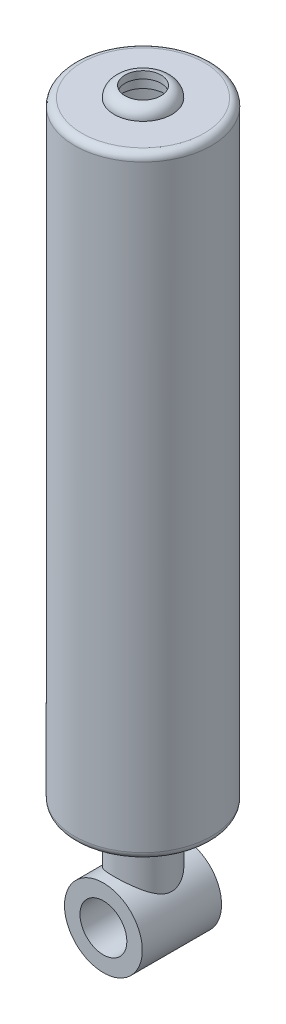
ISO-10303-21;
HEADER;
FILE_DESCRIPTION(('STEP AP214'),'2;1');
FILE_NAME('part.step','',(''),(''),'','','');
FILE_SCHEMA(('AUTOMOTIVE_DESIGN { 1 0 10303 214 1 1 1 1 }'));
ENDSEC;
DATA;
#1=APPLICATION_CONTEXT('core data for automotive mechanical design processes');
#2=APPLICATION_PROTOCOL_DEFINITION('international standard','automotive_design',2000,#1);
#3=PRODUCT_CONTEXT('',#1,'mechanical');
#4=PRODUCT('Part','Part','',(#3));
#5=PRODUCT_RELATED_PRODUCT_CATEGORY('part','',(#4));
#6=PRODUCT_DEFINITION_FORMATION('','',#4);
#7=PRODUCT_DEFINITION_CONTEXT('part definition',#1,'design');
#8=PRODUCT_DEFINITION('design','',#6,#7);
#9=PRODUCT_DEFINITION_SHAPE('','',#8);
#10=(LENGTH_UNIT() NAMED_UNIT(*) SI_UNIT(.MILLI.,.METRE.));
#11=(NAMED_UNIT(*) PLANE_ANGLE_UNIT() SI_UNIT($,.RADIAN.));
#12=(NAMED_UNIT(*) SI_UNIT($,.STERADIAN.) SOLID_ANGLE_UNIT());
#13=UNCERTAINTY_MEASURE_WITH_UNIT(LENGTH_MEASURE(1.E-05),#10,'distance_accuracy_value','');
#14=(GEOMETRIC_REPRESENTATION_CONTEXT(3) GLOBAL_UNCERTAINTY_ASSIGNED_CONTEXT((#13)) GLOBAL_UNIT_ASSIGNED_CONTEXT((#10,
#11,#12)) REPRESENTATION_CONTEXT('',''));
#15=CARTESIAN_POINT('',(0.,0.,0.));
#16=DIRECTION('',(0.,0.,1.));
#17=DIRECTION('',(1.,0.,0.));
#18=AXIS2_PLACEMENT_3D('',#15,#16,#17);
#19=CARTESIAN_POINT('',(0.,0.,22.));
#20=DIRECTION('',(0.,0.,-1.));
#21=DIRECTION('',(-1.,0.,0.));
#22=AXIS2_PLACEMENT_3D('',#19,#20,#21);
#23=CYLINDRICAL_SURFACE('',#22,6.5);
#24=CARTESIAN_POINT('',(0.,0.,22.));
#25=DIRECTION('',(0.,0.,-1.));
#26=DIRECTION('',(-1.,0.,0.));
#27=AXIS2_PLACEMENT_3D('',#24,#25,#26);
#28=CIRCLE('',#27,6.5);
#29=CARTESIAN_POINT('',(-6.5,0.,22.));
#30=VERTEX_POINT('',#29);
#31=EDGE_CURVE('E34',#30,#30,#28,.T.);
#32=ORIENTED_EDGE('',*,*,#31,.F.);
#33=EDGE_LOOP('',(#32));
#34=FACE_BOUND('',#33,.T.);
#35=CARTESIAN_POINT('',(0.,0.,0.));
#36=DIRECTION('',(0.,0.,-1.));
#37=DIRECTION('',(-1.,0.,0.));
#38=AXIS2_PLACEMENT_3D('',#35,#36,#37);
#39=CIRCLE('',#38,6.5);
#40=CARTESIAN_POINT('',(-6.5,0.,0.));
#41=VERTEX_POINT('',#40);
#42=EDGE_CURVE('E380',#41,#41,#39,.T.);
#43=ORIENTED_EDGE('',*,*,#42,.T.);
#44=EDGE_LOOP('',(#43));
#45=FACE_BOUND('',#44,.T.);
#46=ADVANCED_FACE('F30',(#34,#45),#23,.F.);
#47=CARTESIAN_POINT('',(-10.995073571,-11.014063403,22.));
#48=DIRECTION('',(0.,0.,1.));
#49=DIRECTION('',(1.,0.,0.));
#50=AXIS2_PLACEMENT_3D('',#47,#48,#49);
#51=PLANE('',#50);
#52=ORIENTED_EDGE('',*,*,#31,.T.);
#53=EDGE_LOOP('',(#52));
#54=FACE_BOUND('',#53,.T.);
#55=CARTESIAN_POINT('',(0.,0.,22.));
#56=DIRECTION('',(0.,0.,-1.));
#57=DIRECTION('',(-1.,0.,0.));
#58=AXIS2_PLACEMENT_3D('',#55,#56,#57);
#59=CIRCLE('',#58,10.8);
#60=CARTESIAN_POINT('',(-10.8,0.,22.));
#61=VERTEX_POINT('',#60);
#62=EDGE_CURVE('E381',#61,#61,#59,.T.);
#63=ORIENTED_EDGE('',*,*,#62,.F.);
#64=EDGE_LOOP('',(#63));
#65=FACE_BOUND('',#64,.T.);
#66=ADVANCED_FACE('F139',(#54,#65),#51,.T.);
#67=CARTESIAN_POINT('',(-10.995073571,-11.014063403,0.));
#68=DIRECTION('',(0.,0.,1.));
#69=DIRECTION('',(1.,0.,0.));
#70=AXIS2_PLACEMENT_3D('',#67,#68,#69);
#71=PLANE('',#70);
#72=ORIENTED_EDGE('',*,*,#42,.F.);
#73=EDGE_LOOP('',(#72));
#74=FACE_BOUND('',#73,.T.);
#75=CARTESIAN_POINT('',(0.,0.,0.));
#76=DIRECTION('',(0.,0.,-1.));
#77=DIRECTION('',(-1.,0.,0.));
#78=AXIS2_PLACEMENT_3D('',#75,#76,#77);
#79=CIRCLE('',#78,10.8);
#80=CARTESIAN_POINT('',(-10.8,0.,0.));
#81=VERTEX_POINT('',#80);
#82=EDGE_CURVE('E97',#81,#81,#79,.F.);
#83=ORIENTED_EDGE('',*,*,#82,.F.);
#84=EDGE_LOOP('',(#83));
#85=FACE_BOUND('',#84,.T.);
#86=ADVANCED_FACE('F142',(#74,#85),#71,.F.);
#87=CARTESIAN_POINT('',(0.,0.,22.));
#88=DIRECTION('',(0.,0.,-1.));
#89=DIRECTION('',(-1.,0.,0.));
#90=AXIS2_PLACEMENT_3D('',#87,#88,#89);
#91=CYLINDRICAL_SURFACE('',#90,10.8);
#92=ORIENTED_EDGE('',*,*,#82,.T.);
#93=EDGE_LOOP('',(#92));
#94=FACE_BOUND('',#93,.T.);
#95=CARTESIAN_POINT('',(-5.74679859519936E-10,10.8,3.));
#96=CARTESIAN_POINT('',(-0.196073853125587,10.7999997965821,3.00000021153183));
#97=CARTESIAN_POINT('',(-0.392150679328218,10.7946492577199,3.00721908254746));
#98=CARTESIAN_POINT('',(-0.782748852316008,10.7733736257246,3.03597637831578));
#99=CARTESIAN_POINT('',(-0.977269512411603,10.7574440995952,3.05752080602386));
#100=CARTESIAN_POINT('',(-1.36337863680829,10.7153611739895,3.11461242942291));
#101=CARTESIAN_POINT('',(-1.55496288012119,10.6891942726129,3.15017811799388));
#102=CARTESIAN_POINT('',(-1.93362010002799,10.6272263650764,3.23477180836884));
#103=CARTESIAN_POINT('',(-2.12069106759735,10.5914211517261,3.28380568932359));
#104=CARTESIAN_POINT('',(-2.48788747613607,10.5112091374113,3.39428172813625));
#105=CARTESIAN_POINT('',(-2.66804907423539,10.4668576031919,3.45564426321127));
#106=CARTESIAN_POINT('',(-3.02177256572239,10.3702710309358,3.59022822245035));
#107=CARTESIAN_POINT('',(-3.1953318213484,10.3180328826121,3.66345432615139));
#108=CARTESIAN_POINT('',(-3.5349262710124,10.2066748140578,3.82091182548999));
#109=CARTESIAN_POINT('',(-3.70096623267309,10.1475593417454,3.90513611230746));
#110=CARTESIAN_POINT('',(-4.02514814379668,10.0233889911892,4.08389830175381));
#111=CARTESIAN_POINT('',(-4.18328712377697,9.95833190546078,4.17844004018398));
#112=CARTESIAN_POINT('',(-4.50531800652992,9.81711695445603,4.38621765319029));
#113=CARTESIAN_POINT('',(-4.66840995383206,9.74048812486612,4.50037265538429));
#114=CARTESIAN_POINT('',(-4.98428814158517,9.58269534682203,4.73932094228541));
#115=CARTESIAN_POINT('',(-5.13707306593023,9.50153082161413,4.86411558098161));
#116=CARTESIAN_POINT('',(-5.43229552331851,9.33589064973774,5.12387177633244));
#117=CARTESIAN_POINT('',(-5.57471695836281,9.25141015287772,5.25884851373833));
#118=CARTESIAN_POINT('',(-5.84871315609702,9.0806722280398,5.53823916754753));
#119=CARTESIAN_POINT('',(-5.98029091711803,8.99441529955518,5.68265045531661));
#120=CARTESIAN_POINT('',(-6.25750864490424,8.80438176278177,6.01017892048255));
#121=CARTESIAN_POINT('',(-6.40075250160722,8.70052752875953,6.19528762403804));
#122=CARTESIAN_POINT('',(-6.67104996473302,8.49505272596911,6.57822982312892));
#123=CARTESIAN_POINT('',(-6.7980987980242,8.3934328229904,6.77606704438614));
#124=CARTESIAN_POINT('',(-7.03519757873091,8.19571758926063,7.18403796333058));
#125=CARTESIAN_POINT('',(-7.14526535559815,8.09961653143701,7.39415843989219));
#126=CARTESIAN_POINT('',(-7.34750136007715,7.91661626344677,7.82648223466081));
#127=CARTESIAN_POINT('',(-7.43967969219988,7.82971187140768,8.04867864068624));
#128=CARTESIAN_POINT('',(-7.63159320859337,7.64343059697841,8.57891522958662));
#129=CARTESIAN_POINT('',(-7.72415199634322,7.54909207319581,8.89150099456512));
#130=CARTESIAN_POINT('',(-7.83448428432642,7.4339542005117,9.3727429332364));
#131=CARTESIAN_POINT('',(-7.86650067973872,7.3999816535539,9.53512225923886));
#132=CARTESIAN_POINT('',(-7.92057047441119,7.34208008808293,9.86326585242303));
#133=CARTESIAN_POINT('',(-7.94262893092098,7.31814597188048,10.0290283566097));
#134=CARTESIAN_POINT('',(-7.97649742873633,7.2812175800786,10.3642924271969));
#135=CARTESIAN_POINT('',(-7.98821668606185,7.26832024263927,10.533813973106));
#136=CARTESIAN_POINT('',(-8.00081134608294,7.25445437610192,10.8737481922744));
#137=CARTESIAN_POINT('',(-8.00168722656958,7.25348532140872,11.0441608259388));
#138=CARTESIAN_POINT('',(-7.99257155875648,7.26352834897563,11.3844251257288));
#139=CARTESIAN_POINT('',(-7.98257429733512,7.2745467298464,11.5542764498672));
#140=CARTESIAN_POINT('',(-7.95193699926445,7.3080233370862,11.8918735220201));
#141=CARTESIAN_POINT('',(-7.93129579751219,7.33048281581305,12.0596190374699));
#142=CARTESIAN_POINT('',(-7.87723780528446,7.38856195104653,12.4082837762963));
#143=CARTESIAN_POINT('',(-7.84275526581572,7.4252676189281,12.5888555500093));
#144=CARTESIAN_POINT('',(-7.76213885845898,7.50949985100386,12.9448789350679));
#145=CARTESIAN_POINT('',(-7.71599721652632,7.55703363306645,13.1203270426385));
#146=CARTESIAN_POINT('',(-7.61271453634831,7.66106729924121,13.465585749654));
#147=CARTESIAN_POINT('',(-7.55555251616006,7.71758424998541,13.6353848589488));
#148=CARTESIAN_POINT('',(-7.4309787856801,7.83760393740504,13.9685315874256));
#149=CARTESIAN_POINT('',(-7.36356977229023,7.90110483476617,14.1318808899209));
#150=CARTESIAN_POINT('',(-7.19258635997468,8.05757896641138,14.5105926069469));
#151=CARTESIAN_POINT('',(-7.08480350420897,8.15283503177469,14.7231192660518));
#152=CARTESIAN_POINT('',(-6.85215307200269,8.34932365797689,15.1357127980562));
#153=CARTESIAN_POINT('',(-6.72727965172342,8.45055825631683,15.3357753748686));
#154=CARTESIAN_POINT('',(-6.46102961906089,8.655829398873,15.7233911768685));
#155=CARTESIAN_POINT('',(-6.31963737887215,8.75986852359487,15.9109322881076));
#156=CARTESIAN_POINT('',(-6.02092544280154,8.96780783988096,16.2729033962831));
#157=CARTESIAN_POINT('',(-5.86360767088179,9.07170804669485,16.4473349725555));
#158=CARTESIAN_POINT('',(-5.53071411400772,9.27848107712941,16.7851823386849));
#159=CARTESIAN_POINT('',(-5.35488559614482,9.38131057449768,16.9483761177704));
#160=CARTESIAN_POINT('',(-4.98746208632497,9.58170196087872,17.2596476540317));
#161=CARTESIAN_POINT('',(-4.79586526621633,9.67926323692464,17.4077236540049));
#162=CARTESIAN_POINT('',(-4.39777000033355,9.8665053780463,17.6872017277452));
#163=CARTESIAN_POINT('',(-4.19129629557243,9.95619880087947,17.8186305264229));
#164=CARTESIAN_POINT('',(-3.76403650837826,10.1254515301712,18.0634687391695));
#165=CARTESIAN_POINT('',(-3.54325618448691,10.205014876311,18.1768853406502));
#166=CARTESIAN_POINT('',(-3.14654951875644,10.3330029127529,18.3575746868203));
#167=CARTESIAN_POINT('',(-2.97350657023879,10.3841992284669,18.4292452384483));
#168=CARTESIAN_POINT('',(-2.62093896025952,10.4787387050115,18.5608241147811));
#169=CARTESIAN_POINT('',(-2.44141575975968,10.5220836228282,18.6207350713));
#170=CARTESIAN_POINT('',(-2.07716948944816,10.5999993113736,18.7279582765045));
#171=CARTESIAN_POINT('',(-1.89245716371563,10.6345869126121,18.7752947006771));
#172=CARTESIAN_POINT('',(-1.51872493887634,10.6943567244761,18.856846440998));
#173=CARTESIAN_POINT('',(-1.32970671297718,10.7195425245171,18.8910667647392));
#174=CARTESIAN_POINT('',(-0.951315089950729,10.7596787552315,18.9455031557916));
#175=CARTESIAN_POINT('',(-0.761983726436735,10.7747675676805,18.9659086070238));
#176=CARTESIAN_POINT('',(-0.381769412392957,10.7949294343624,18.9931586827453));
#177=CARTESIAN_POINT('',(-0.190886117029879,10.8000001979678,19.0000002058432));
#178=CARTESIAN_POINT('',(0.196073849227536,10.799999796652,18.9999997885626));
#179=CARTESIAN_POINT('',(0.392150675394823,10.7946492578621,18.9927809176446));
#180=CARTESIAN_POINT('',(0.782748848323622,10.7733736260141,18.9640236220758));
#181=CARTESIAN_POINT('',(0.977269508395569,10.7574440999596,18.9424791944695));
#182=CARTESIAN_POINT('',(1.36337863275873,10.7153611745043,18.8853875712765));
#183=CARTESIAN_POINT('',(1.55496287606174,10.6891942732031,18.8498218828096));
#184=CARTESIAN_POINT('',(1.93362009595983,10.6272263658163,18.7652281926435));
#185=CARTESIAN_POINT('',(2.12069106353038,10.5914211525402,18.7161943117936));
#186=CARTESIAN_POINT('',(2.48788747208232,10.5112091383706,18.6057182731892));
#187=CARTESIAN_POINT('',(2.66804907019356,10.4668576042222,18.5443557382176));
#188=CARTESIAN_POINT('',(3.02177256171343,10.370271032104,18.409771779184));
#189=CARTESIAN_POINT('',(3.19533181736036,10.3180328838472,18.336545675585));
#190=CARTESIAN_POINT('',(3.53492626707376,10.2066748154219,18.1790881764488));
#191=CARTESIAN_POINT('',(3.70096622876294,10.1475593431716,18.0948638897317));
#192=CARTESIAN_POINT('',(4.02514813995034,10.0233889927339,17.9161017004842));
#193=CARTESIAN_POINT('',(4.18328711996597,9.95833190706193,17.8215599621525));
#194=CARTESIAN_POINT('',(4.50531800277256,9.81711695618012,17.6137823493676));
#195=CARTESIAN_POINT('',(4.66840995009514,9.74048812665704,17.4996273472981));
#196=CARTESIAN_POINT('',(4.98428813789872,9.58269534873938,17.2606790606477));
#197=CARTESIAN_POINT('',(5.13707306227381,9.50153082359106,17.1358844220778));
#198=CARTESIAN_POINT('',(5.43229551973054,9.33589065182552,16.8761282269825));
#199=CARTESIAN_POINT('',(5.57471695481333,9.25141015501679,16.7411514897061));
#200=CARTESIAN_POINT('',(5.84871315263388,9.08067223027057,16.4617608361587));
#201=CARTESIAN_POINT('',(5.98029091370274,8.99441530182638,16.317349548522));
#202=CARTESIAN_POINT('',(6.25750864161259,8.80438176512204,15.9898210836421));
#203=CARTESIAN_POINT('',(6.40075249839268,8.70052753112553,15.8047123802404));
#204=CARTESIAN_POINT('',(6.67104996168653,8.49505272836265,15.4217701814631));
#205=CARTESIAN_POINT('',(6.79809879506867,8.39343282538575,15.2239329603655));
#206=CARTESIAN_POINT('',(7.03519757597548,8.19571759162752,14.815962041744));
#207=CARTESIAN_POINT('',(7.14526535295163,8.09961653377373,14.6058415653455));
#208=CARTESIAN_POINT('',(7.34750135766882,7.91661626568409,14.1735177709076));
#209=CARTESIAN_POINT('',(7.43967968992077,7.82971187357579,13.9513213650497));
#210=CARTESIAN_POINT('',(7.63159320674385,7.64343059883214,13.4210847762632));
#211=CARTESIAN_POINT('',(7.72415199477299,7.54909207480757,13.1084990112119));
#212=CARTESIAN_POINT('',(7.83448428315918,7.43395420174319,12.6272570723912));
#213=CARTESIAN_POINT('',(7.86650067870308,7.39998165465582,12.4648777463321));
#214=CARTESIAN_POINT('',(7.92057047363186,7.34208008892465,12.1367341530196));
#215=CARTESIAN_POINT('',(7.94262893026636,7.31814597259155,11.9709716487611));
#216=CARTESIAN_POINT('',(7.97649742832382,7.28121758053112,11.6357075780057));
#217=CARTESIAN_POINT('',(7.98821668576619,7.26832024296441,11.4661860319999));
#218=CARTESIAN_POINT('',(8.00081134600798,7.25445437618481,11.1262518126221));
#219=CARTESIAN_POINT('',(8.00168722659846,7.25348532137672,10.9558391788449));
#220=CARTESIAN_POINT('',(7.99257155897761,7.26352834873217,10.6155748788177));
#221=CARTESIAN_POINT('',(7.98257429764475,7.27454672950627,10.4457235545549));
#222=CARTESIAN_POINT('',(7.9519369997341,7.3080233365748,10.1081264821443));
#223=CARTESIAN_POINT('',(7.93129579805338,7.33048281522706,9.94038096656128));
#224=CARTESIAN_POINT('',(7.87723780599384,7.38856195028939,9.59171622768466));
#225=CARTESIAN_POINT('',(7.84275526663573,7.42526761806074,9.41114445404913));
#226=CARTESIAN_POINT('',(7.76213885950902,7.50949984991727,9.05512106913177));
#227=CARTESIAN_POINT('',(7.71599721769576,7.55703363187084,8.87967296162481));
#228=CARTESIAN_POINT('',(7.6127145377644,7.6610672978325,8.53441425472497));
#229=CARTESIAN_POINT('',(7.55555251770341,7.71758424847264,8.36461514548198));
#230=CARTESIAN_POINT('',(7.43097878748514,7.83760393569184,8.03146841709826));
#231=CARTESIAN_POINT('',(7.36356977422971,7.90110483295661,7.86811911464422));
#232=CARTESIAN_POINT('',(7.19258636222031,8.05757896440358,7.48940739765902));
#233=CARTESIAN_POINT('',(7.08480350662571,8.15283502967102,7.27688073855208));
#234=CARTESIAN_POINT('',(6.85215307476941,8.34932365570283,6.8642872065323));
#235=CARTESIAN_POINT('',(6.72727965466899,8.45055825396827,6.66422462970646));
#236=CARTESIAN_POINT('',(6.46102962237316,8.65582939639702,6.27660882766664));
#237=CARTESIAN_POINT('',(6.31963738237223,8.75986852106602,6.08906771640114));
#238=CARTESIAN_POINT('',(6.02092544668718,8.96780783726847,5.72709660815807));
#239=CARTESIAN_POINT('',(5.86360767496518,9.0717080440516,5.55266503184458));
#240=CARTESIAN_POINT('',(5.53071411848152,9.27848107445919,5.21481766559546));
#241=CARTESIAN_POINT('',(5.35488560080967,9.38131057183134,5.05162388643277));
#242=CARTESIAN_POINT('',(4.98746209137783,9.58170195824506,4.74035234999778));
#243=CARTESIAN_POINT('',(4.79586527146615,9.67926323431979,4.59227634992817));
#244=CARTESIAN_POINT('',(4.39777000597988,9.86650537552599,4.31279827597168));
#245=CARTESIAN_POINT('',(4.19129630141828,9.95619879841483,4.18136947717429));
#246=CARTESIAN_POINT('',(3.76403651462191,10.1254515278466,3.93653126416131));
#247=CARTESIAN_POINT('',(3.54325619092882,10.2050148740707,3.82311466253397));
#248=CARTESIAN_POINT('',(3.14654952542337,10.3330029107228,3.64242531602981));
#249=CARTESIAN_POINT('',(2.97350657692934,10.3841992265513,3.57075476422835));
#250=CARTESIAN_POINT('',(2.62093896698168,10.4787387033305,3.43917588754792));
#251=CARTESIAN_POINT('',(2.44141576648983,10.5220836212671,3.37926493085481));
#252=CARTESIAN_POINT('',(2.07716949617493,10.5999993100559,3.27204172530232));
#253=CARTESIAN_POINT('',(1.892457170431,10.6345869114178,3.22470530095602));
#254=CARTESIAN_POINT('',(1.51872494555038,10.694356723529,3.14315356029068));
#255=CARTESIAN_POINT('',(1.32970671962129,10.7195425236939,3.10893323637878));
#256=CARTESIAN_POINT('',(0.951315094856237,10.7596787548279,3.05449684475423));
#257=CARTESIAN_POINT('',(0.761983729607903,10.7747675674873,3.0340913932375));
#258=CARTESIAN_POINT('',(0.381769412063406,10.7949294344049,3.00684131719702));
#259=CARTESIAN_POINT('',(0.190886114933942,10.8000001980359,2.99999979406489));
#260=CARTESIAN_POINT('',(-5.74679859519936E-10,10.8,3.));
#261=B_SPLINE_CURVE_WITH_KNOTS('',3,(#95,#96,#97,#98,#99,#100,#101,#102,#103,#104,#105,#106,
#107,#108,#109,#110,#111,#112,#113,#114,#115,#116,#117,#118,#119,#120,#121,#122,#123,#124,#125,
#126,#127,#128,#129,#130,#131,#132,#133,#134,#135,#136,#137,#138,#139,#140,#141,#142,#143,#144,
#145,#146,#147,#148,#149,#150,#151,#152,#153,#154,#155,#156,#157,#158,#159,#160,#161,#162,#163,
#164,#165,#166,#167,#168,#169,#170,#171,#172,#173,#174,#175,#176,#177,#178,#179,#180,#181,#182,
#183,#184,#185,#186,#187,#188,#189,#190,#191,#192,#193,#194,#195,#196,#197,#198,#199,#200,#201,
#202,#203,#204,#205,#206,#207,#208,#209,#210,#211,#212,#213,#214,#215,#216,#217,#218,#219,#220,
#221,#222,#223,#224,#225,#226,#227,#228,#229,#230,#231,#232,#233,#234,#235,#236,#237,#238,#239,
#240,#241,#242,#243,#244,#245,#246,#247,#248,#249,#250,#251,#252,#253,#254,#255,#256,#257,#258,
#259,#260),.UNSPECIFIED.,.T.,.F.,(4,2,2,2,2,2,2,2,2,2,2,2,2,2,2,2,2,2,2,2,2,2,2,2,2,2,2,2,2,2,2,
2,2,2,2,2,2,2,2,2,2,2,2,2,2,2,2,2,2,2,2,2,2,2,2,2,2,2,2,2,2,2,2,2,2,2,2,2,2,2,2,2,2,2,2,2,2,2,2,
2,2,2,4),(0.,0.588022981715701,1.17629252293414,1.76534055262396,2.35464612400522,
2.9402614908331,3.52610841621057,4.1115785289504,4.69726705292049,5.33660587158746,
5.97602617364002,6.61641939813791,7.25663495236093,8.02398356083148,8.79155780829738,
9.55832056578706,10.3246489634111,11.3385071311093,11.8448645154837,12.3509644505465,
12.8614652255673,13.3719435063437,13.8826901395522,14.3934926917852,14.9550571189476,
15.5169969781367,16.0800174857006,16.6428900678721,17.4116984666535,18.180770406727,
18.9505759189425,19.7202885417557,20.5023677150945,21.2845376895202,22.0654356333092,
22.8460211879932,23.4279623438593,24.0097731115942,24.590457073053,25.1709191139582,
25.7432532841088,26.3157183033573,26.9037412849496,27.4920108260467,28.0810588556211,
28.6703644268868,29.255979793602,29.8418267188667,30.4272968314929,31.0129853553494,
31.6523241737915,32.2917444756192,32.9321376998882,33.5723532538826,34.3397018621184,
35.107276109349,35.8740388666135,36.6403672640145,37.6542254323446,38.1605828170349,
38.6666827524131,39.1771835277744,39.687661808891,40.1984084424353,40.709210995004,
41.2707754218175,41.8327152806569,42.3957357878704,42.9586083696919,43.7274167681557,
44.4964887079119,45.2662942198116,46.0360068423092,46.8180860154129,47.6002559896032,
48.3811539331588,49.1617394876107,49.7436806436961,50.3254914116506,50.9061753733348,
51.4866374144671,52.0589715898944,52.6314366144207),.UNSPECIFIED.);
#262=CARTESIAN_POINT('',(-5.74679859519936E-10,10.8,3.));
#263=VERTEX_POINT('',#262);
#264=EDGE_CURVE('E89',#263,#263,#261,.T.);
#265=ORIENTED_EDGE('',*,*,#264,.F.);
#266=EDGE_LOOP('',(#265));
#267=FACE_BOUND('',#266,.T.);
#268=ORIENTED_EDGE('',*,*,#62,.T.);
#269=EDGE_LOOP('',(#268));
#270=FACE_BOUND('',#269,.T.);
#271=ADVANCED_FACE('F99',(#94,#267,#270),#91,.T.);
#272=CARTESIAN_POINT('',(0.,21.,11.));
#273=DIRECTION('',(0.,-1.,0.));
#274=DIRECTION('',(0.,0.,-1.));
#275=AXIS2_PLACEMENT_3D('',#272,#273,#274);
#276=CYLINDRICAL_SURFACE('',#275,8.);
#277=CARTESIAN_POINT('',(0.,21.,11.));
#278=DIRECTION('',(0.,-1.,0.));
#279=DIRECTION('',(0.,0.,-1.));
#280=AXIS2_PLACEMENT_3D('',#277,#278,#279);
#281=CIRCLE('',#280,8.);
#282=CARTESIAN_POINT('',(0.,21.,3.));
#283=VERTEX_POINT('',#282);
#284=EDGE_CURVE('E86',#283,#283,#281,.F.);
#285=ORIENTED_EDGE('',*,*,#284,.F.);
#286=EDGE_LOOP('',(#285));
#287=FACE_BOUND('',#286,.T.);
#288=ORIENTED_EDGE('',*,*,#264,.T.);
#289=EDGE_LOOP('',(#288));
#290=FACE_BOUND('',#289,.T.);
#291=ADVANCED_FACE('F102',(#287,#290),#276,.T.);
#292=CARTESIAN_POINT('',(-10.198206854,21.,21.180623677));
#293=DIRECTION('',(0.,-1.,0.));
#294=DIRECTION('',(0.,0.,-1.));
#295=AXIS2_PLACEMENT_3D('',#292,#293,#294);
#296=PLANE('',#295);
#297=ORIENTED_EDGE('',*,*,#284,.T.);
#298=EDGE_LOOP('',(#297));
#299=FACE_BOUND('',#298,.T.);
#300=CARTESIAN_POINT('',(0.,21.,11.));
#301=DIRECTION('',(0.,-1.,0.));
#302=DIRECTION('',(0.,0.,-1.));
#303=AXIS2_PLACEMENT_3D('',#300,#301,#302);
#304=CIRCLE('',#303,10.0000000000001);
#305=CARTESIAN_POINT('',(0.,21.,0.999999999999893));
#306=VERTEX_POINT('',#305);
#307=EDGE_CURVE('E83',#306,#306,#304,.F.);
#308=ORIENTED_EDGE('',*,*,#307,.F.);
#309=EDGE_LOOP('',(#308));
#310=FACE_BOUND('',#309,.T.);
#311=ADVANCED_FACE('F106',(#299,#310),#296,.T.);
#312=CARTESIAN_POINT('',(0.,24.,11.));
#313=DIRECTION('',(0.,-1.,0.));
#314=DIRECTION('',(0.,0.,-1.));
#315=AXIS2_PLACEMENT_3D('',#312,#313,#314);
#316=TOROIDAL_SURFACE('',#315,10.,3.);
#317=CARTESIAN_POINT('',(0.,24.,11.));
#318=DIRECTION('',(0.,-1.,0.));
#319=DIRECTION('',(0.,0.,-1.));
#320=AXIS2_PLACEMENT_3D('',#317,#318,#319);
#321=CIRCLE('',#320,13.);
#322=CARTESIAN_POINT('',(0.,24.,-2.));
#323=VERTEX_POINT('',#322);
#324=EDGE_CURVE('E80',#323,#323,#321,.F.);
#325=ORIENTED_EDGE('',*,*,#324,.F.);
#326=EDGE_LOOP('',(#325));
#327=FACE_BOUND('',#326,.T.);
#328=ORIENTED_EDGE('',*,*,#307,.T.);
#329=EDGE_LOOP('',(#328));
#330=FACE_BOUND('',#329,.T.);
#331=ADVANCED_FACE('F149',(#327,#330),#316,.T.);
#332=CARTESIAN_POINT('',(-17.336951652,24.,28.307060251));
#333=DIRECTION('',(0.,-1.,0.));
#334=DIRECTION('',(0.,0.,-1.));
#335=AXIS2_PLACEMENT_3D('',#332,#333,#334);
#336=PLANE('',#335);
#337=ORIENTED_EDGE('',*,*,#324,.T.);
#338=EDGE_LOOP('',(#337));
#339=FACE_BOUND('',#338,.T.);
#340=CARTESIAN_POINT('',(0.,24.,11.));
#341=DIRECTION('',(0.,-1.,0.));
#342=DIRECTION('',(0.,0.,-1.));
#343=AXIS2_PLACEMENT_3D('',#340,#341,#342);
#344=CIRCLE('',#343,17.0000000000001);
#345=CARTESIAN_POINT('',(0.,24.,-6.00000000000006));
#346=VERTEX_POINT('',#345);
#347=EDGE_CURVE('E77',#346,#346,#344,.F.);
#348=ORIENTED_EDGE('',*,*,#347,.F.);
#349=EDGE_LOOP('',(#348));
#350=FACE_BOUND('',#349,.T.);
#351=ADVANCED_FACE('F153',(#339,#350),#336,.T.);
#352=CARTESIAN_POINT('',(0.,26.,11.));
#353=DIRECTION('',(0.,-1.,0.));
#354=DIRECTION('',(0.,0.,-1.));
#355=AXIS2_PLACEMENT_3D('',#352,#353,#354);
#356=TOROIDAL_SURFACE('',#355,17.,2.);
#357=CARTESIAN_POINT('',(0.,26.,11.));
#358=DIRECTION('',(0.,-1.,0.));
#359=DIRECTION('',(0.,0.,-1.));
#360=AXIS2_PLACEMENT_3D('',#357,#358,#359);
#361=CIRCLE('',#360,19.);
#362=CARTESIAN_POINT('',(0.,26.,-8.));
#363=VERTEX_POINT('',#362);
#364=EDGE_CURVE('E46',#363,#363,#361,.F.);
#365=ORIENTED_EDGE('',*,*,#364,.F.);
#366=EDGE_LOOP('',(#365));
#367=FACE_BOUND('',#366,.T.);
#368=ORIENTED_EDGE('',*,*,#347,.T.);
#369=EDGE_LOOP('',(#368));
#370=FACE_BOUND('',#369,.T.);
#371=ADVANCED_FACE('F112',(#367,#370),#356,.T.);
#372=CARTESIAN_POINT('',(0.,192.,11.));
#373=DIRECTION('',(0.,-1.,0.));
#374=DIRECTION('',(0.,0.,-1.));
#375=AXIS2_PLACEMENT_3D('',#372,#373,#374);
#376=CYLINDRICAL_SURFACE('',#375,19.);
#377=CARTESIAN_POINT('',(0.,192.,11.));
#378=DIRECTION('',(0.,1.,0.));
#379=DIRECTION('',(0.,0.,1.));
#380=AXIS2_PLACEMENT_3D('',#377,#378,#379);
#381=CIRCLE('',#380,19.);
#382=CARTESIAN_POINT('',(0.,192.,30.));
#383=VERTEX_POINT('',#382);
#384=EDGE_CURVE('E76',#383,#383,#381,.T.);
#385=ORIENTED_EDGE('',*,*,#384,.F.);
#386=EDGE_LOOP('',(#385));
#387=FACE_BOUND('',#386,.T.);
#388=ORIENTED_EDGE('',*,*,#364,.T.);
#389=EDGE_LOOP('',(#388));
#390=FACE_BOUND('',#389,.T.);
#391=ADVANCED_FACE('F108',(#387,#390),#376,.T.);
#392=CARTESIAN_POINT('',(0.,192.,11.));
#393=DIRECTION('',(0.,1.,0.));
#394=DIRECTION('',(0.,0.,1.));
#395=AXIS2_PLACEMENT_3D('',#392,#393,#394);
#396=TOROIDAL_SURFACE('',#395,17.,2.);
#397=ORIENTED_EDGE('',*,*,#384,.T.);
#398=EDGE_LOOP('',(#397));
#399=FACE_BOUND('',#398,.T.);
#400=CARTESIAN_POINT('',(0.,194.,11.));
#401=DIRECTION('',(0.,1.,0.));
#402=DIRECTION('',(0.,0.,1.));
#403=AXIS2_PLACEMENT_3D('',#400,#401,#402);
#404=CIRCLE('',#403,16.9999999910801);
#405=CARTESIAN_POINT('',(0.,194.,27.9999999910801));
#406=VERTEX_POINT('',#405);
#407=EDGE_CURVE('E73',#406,#406,#404,.T.);
#408=ORIENTED_EDGE('',*,*,#407,.F.);
#409=EDGE_LOOP('',(#408));
#410=FACE_BOUND('',#409,.T.);
#411=ADVANCED_FACE('F111',(#399,#410),#396,.T.);
#412=CARTESIAN_POINT('',(-17.336951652,194.,-6.307060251));
#413=DIRECTION('',(0.,1.,0.));
#414=DIRECTION('',(0.,0.,1.));
#415=AXIS2_PLACEMENT_3D('',#412,#413,#414);
#416=PLANE('',#415);
#417=CARTESIAN_POINT('',(0.,194.,11.));
#418=DIRECTION('',(0.,1.,0.));
#419=DIRECTION('',(0.,0.,1.));
#420=AXIS2_PLACEMENT_3D('',#417,#418,#419);
#421=CIRCLE('',#420,8.);
#422=CARTESIAN_POINT('',(0.,194.,19.));
#423=VERTEX_POINT('',#422);
#424=EDGE_CURVE('E70',#423,#423,#421,.T.);
#425=ORIENTED_EDGE('',*,*,#424,.F.);
#426=EDGE_LOOP('',(#425));
#427=FACE_BOUND('',#426,.T.);
#428=ORIENTED_EDGE('',*,*,#407,.T.);
#429=EDGE_LOOP('',(#428));
#430=FACE_BOUND('',#429,.T.);
#431=ADVANCED_FACE('F163',(#427,#430),#416,.T.);
#432=CARTESIAN_POINT('',(0.,194.,11.));
#433=DIRECTION('',(0.,1.,0.));
#434=DIRECTION('',(0.,0.,1.));
#435=AXIS2_PLACEMENT_3D('',#432,#433,#434);
#436=TOROIDAL_SURFACE('',#435,5.,3.);
#437=CARTESIAN_POINT('',(0.,197.,11.));
#438=DIRECTION('',(0.,1.,0.));
#439=DIRECTION('',(0.,0.,1.));
#440=AXIS2_PLACEMENT_3D('',#437,#438,#439);
#441=CIRCLE('',#440,5.);
#442=CARTESIAN_POINT('',(0.,197.,16.));
#443=VERTEX_POINT('',#442);
#444=EDGE_CURVE('E69',#443,#443,#441,.F.);
#445=ORIENTED_EDGE('',*,*,#444,.T.);
#446=EDGE_LOOP('',(#445));
#447=FACE_BOUND('',#446,.T.);
#448=ORIENTED_EDGE('',*,*,#424,.T.);
#449=EDGE_LOOP('',(#448));
#450=FACE_BOUND('',#449,.T.);
#451=ADVANCED_FACE('F118',(#447,#450),#436,.T.);
#452=CARTESIAN_POINT('',(0.,195.,11.));
#453=DIRECTION('',(0.,1.,0.));
#454=DIRECTION('',(0.,0.,1.));
#455=AXIS2_PLACEMENT_3D('',#452,#453,#454);
#456=CYLINDRICAL_SURFACE('',#455,5.);
#457=CARTESIAN_POINT('',(0.,195.,11.));
#458=DIRECTION('',(0.,1.,0.));
#459=DIRECTION('',(0.,0.,1.));
#460=AXIS2_PLACEMENT_3D('',#457,#458,#459);
#461=CIRCLE('',#460,5.);
#462=CARTESIAN_POINT('',(0.,195.,16.));
#463=VERTEX_POINT('',#462);
#464=EDGE_CURVE('E66',#463,#463,#461,.T.);
#465=ORIENTED_EDGE('',*,*,#464,.F.);
#466=EDGE_LOOP('',(#465));
#467=FACE_BOUND('',#466,.T.);
#468=ORIENTED_EDGE('',*,*,#444,.F.);
#469=EDGE_LOOP('',(#468));
#470=FACE_BOUND('',#469,.T.);
#471=ADVANCED_FACE('F114',(#467,#470),#456,.F.);
#472=CARTESIAN_POINT('',(-6.118924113,195.,17.108374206));
#473=DIRECTION('',(0.,-1.,0.));
#474=DIRECTION('',(0.,0.,-1.));
#475=AXIS2_PLACEMENT_3D('',#472,#473,#474);
#476=PLANE('',#475);
#477=ORIENTED_EDGE('',*,*,#464,.T.);
#478=EDGE_LOOP('',(#477));
#479=FACE_BOUND('',#478,.T.);
#480=CARTESIAN_POINT('',(0.,195.,11.));
#481=DIRECTION('',(0.,-1.,0.));
#482=DIRECTION('',(0.,0.,-1.));
#483=AXIS2_PLACEMENT_3D('',#480,#481,#482);
#484=CIRCLE('',#483,6.);
#485=CARTESIAN_POINT('',(0.,195.,5.));
#486=VERTEX_POINT('',#485);
#487=EDGE_CURVE('E63',#486,#486,#484,.T.);
#488=ORIENTED_EDGE('',*,*,#487,.T.);
#489=EDGE_LOOP('',(#488));
#490=FACE_BOUND('',#489,.T.);
#491=ADVANCED_FACE('F117',(#479,#490),#476,.T.);
#492=CARTESIAN_POINT('',(0.,195.,11.));
#493=DIRECTION('',(0.,-1.,0.));
#494=DIRECTION('',(0.,0.,-1.));
#495=AXIS2_PLACEMENT_3D('',#492,#493,#494);
#496=CYLINDRICAL_SURFACE('',#495,6.);
#497=CARTESIAN_POINT('',(0.,192.,11.));
#498=DIRECTION('',(0.,-1.,0.));
#499=DIRECTION('',(0.,0.,-1.));
#500=AXIS2_PLACEMENT_3D('',#497,#498,#499);
#501=CIRCLE('',#500,6.);
#502=CARTESIAN_POINT('',(0.,192.,5.));
#503=VERTEX_POINT('',#502);
#504=EDGE_CURVE('E60',#503,#503,#501,.F.);
#505=ORIENTED_EDGE('',*,*,#504,.F.);
#506=EDGE_LOOP('',(#505));
#507=FACE_BOUND('',#506,.T.);
#508=ORIENTED_EDGE('',*,*,#487,.F.);
#509=EDGE_LOOP('',(#508));
#510=FACE_BOUND('',#509,.T.);
#511=ADVANCED_FACE('F120',(#507,#510),#496,.F.);
#512=CARTESIAN_POINT('',(-17.336951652,192.,28.307060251));
#513=DIRECTION('',(0.,-1.,0.));
#514=DIRECTION('',(0.,0.,-1.));
#515=AXIS2_PLACEMENT_3D('',#512,#513,#514);
#516=PLANE('',#515);
#517=ORIENTED_EDGE('',*,*,#504,.T.);
#518=EDGE_LOOP('',(#517));
#519=FACE_BOUND('',#518,.T.);
#520=CARTESIAN_POINT('',(0.,192.,11.));
#521=DIRECTION('',(0.,-1.,0.));
#522=DIRECTION('',(0.,0.,-1.));
#523=AXIS2_PLACEMENT_3D('',#520,#521,#522);
#524=CIRCLE('',#523,17.);
#525=CARTESIAN_POINT('',(0.,192.,-6.));
#526=VERTEX_POINT('',#525);
#527=EDGE_CURVE('E57',#526,#526,#524,.T.);
#528=ORIENTED_EDGE('',*,*,#527,.T.);
#529=EDGE_LOOP('',(#528));
#530=FACE_BOUND('',#529,.T.);
#531=ADVANCED_FACE('F123',(#519,#530),#516,.T.);
#532=CARTESIAN_POINT('',(0.,192.,11.));
#533=DIRECTION('',(0.,-1.,0.));
#534=DIRECTION('',(0.,0.,-1.));
#535=AXIS2_PLACEMENT_3D('',#532,#533,#534);
#536=CYLINDRICAL_SURFACE('',#535,17.);
#537=CARTESIAN_POINT('',(0.,26.,11.));
#538=DIRECTION('',(0.,-1.,0.));
#539=DIRECTION('',(0.,0.,-1.));
#540=AXIS2_PLACEMENT_3D('',#537,#538,#539);
#541=CIRCLE('',#540,17.);
#542=CARTESIAN_POINT('',(0.,26.,-6.));
#543=VERTEX_POINT('',#542);
#544=EDGE_CURVE('E54',#543,#543,#541,.F.);
#545=ORIENTED_EDGE('',*,*,#544,.F.);
#546=EDGE_LOOP('',(#545));
#547=FACE_BOUND('',#546,.T.);
#548=ORIENTED_EDGE('',*,*,#527,.F.);
#549=EDGE_LOOP('',(#548));
#550=FACE_BOUND('',#549,.T.);
#551=ADVANCED_FACE('F125',(#547,#550),#536,.F.);
#552=CARTESIAN_POINT('',(-17.336951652,26.,-6.204614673));
#553=DIRECTION('',(0.,1.,0.));
#554=DIRECTION('',(0.,0.,1.));
#555=AXIS2_PLACEMENT_3D('',#552,#553,#554);
#556=PLANE('',#555);
#557=CARTESIAN_POINT('',(0.,26.,11.));
#558=DIRECTION('',(0.,-1.,0.));
#559=DIRECTION('',(1.,0.,0.));
#560=AXIS2_PLACEMENT_3D('',#557,#558,#559);
#561=CIRCLE('',#560,8.);
#562=CARTESIAN_POINT('',(8.,26.,11.));
#563=VERTEX_POINT('',#562);
#564=EDGE_CURVE('E51',#563,#563,#561,.F.);
#565=ORIENTED_EDGE('',*,*,#564,.F.);
#566=EDGE_LOOP('',(#565));
#567=FACE_BOUND('',#566,.T.);
#568=ORIENTED_EDGE('',*,*,#544,.T.);
#569=EDGE_LOOP('',(#568));
#570=FACE_BOUND('',#569,.T.);
#571=ADVANCED_FACE('F128',(#567,#570),#556,.T.);
#572=CARTESIAN_POINT('',(0.,30.,11.));
#573=DIRECTION('',(0.,-1.,0.));
#574=DIRECTION('',(1.,0.,0.));
#575=AXIS2_PLACEMENT_3D('',#572,#573,#574);
#576=CYLINDRICAL_SURFACE('',#575,8.);
#577=ORIENTED_EDGE('',*,*,#564,.T.);
#578=EDGE_LOOP('',(#577));
#579=FACE_BOUND('',#578,.T.);
#580=CARTESIAN_POINT('',(0.,30.,11.));
#581=DIRECTION('',(0.,-1.,0.));
#582=DIRECTION('',(1.,0.,0.));
#583=AXIS2_PLACEMENT_3D('',#580,#581,#582);
#584=CIRCLE('',#583,8.);
#585=CARTESIAN_POINT('',(8.,30.,11.));
#586=VERTEX_POINT('',#585);
#587=EDGE_CURVE('E43',#586,#586,#584,.F.);
#588=ORIENTED_EDGE('',*,*,#587,.F.);
#589=EDGE_LOOP('',(#588));
#590=FACE_BOUND('',#589,.T.);
#591=ADVANCED_FACE('F130',(#579,#590),#576,.T.);
#592=CARTESIAN_POINT('',(-8.158565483,30.,2.855501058));
#593=DIRECTION('',(0.,1.,0.));
#594=DIRECTION('',(0.,0.,1.));
#595=AXIS2_PLACEMENT_3D('',#592,#593,#594);
#596=PLANE('',#595);
#597=CARTESIAN_POINT('',(0.,30.,11.));
#598=DIRECTION('',(0.,1.,0.));
#599=DIRECTION('',(-1.,0.,0.));
#600=AXIS2_PLACEMENT_3D('',#597,#598,#599);
#601=CIRCLE('',#600,5.);
#602=CARTESIAN_POINT('',(-5.,30.,11.));
#603=VERTEX_POINT('',#602);
#604=EDGE_CURVE('E38',#603,#603,#601,.F.);
#605=ORIENTED_EDGE('',*,*,#604,.T.);
#606=EDGE_LOOP('',(#605));
#607=FACE_BOUND('',#606,.T.);
#608=ORIENTED_EDGE('',*,*,#587,.T.);
#609=EDGE_LOOP('',(#608));
#610=FACE_BOUND('',#609,.T.);
#611=ADVANCED_FACE('F133',(#607,#610),#596,.T.);
#612=CARTESIAN_POINT('',(-5.099103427,20.,5.909688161));
#613=DIRECTION('',(0.,1.,0.));
#614=DIRECTION('',(0.,0.,1.));
#615=AXIS2_PLACEMENT_3D('',#612,#613,#614);
#616=PLANE('',#615);
#617=CARTESIAN_POINT('',(0.,20.,11.));
#618=DIRECTION('',(0.,1.,0.));
#619=DIRECTION('',(-1.,0.,0.));
#620=AXIS2_PLACEMENT_3D('',#617,#618,#619);
#621=CIRCLE('',#620,5.);
#622=CARTESIAN_POINT('',(-5.,20.,11.));
#623=VERTEX_POINT('',#622);
#624=EDGE_CURVE('E10',#623,#623,#621,.T.);
#625=ORIENTED_EDGE('',*,*,#624,.T.);
#626=EDGE_LOOP('',(#625));
#627=FACE_BOUND('',#626,.T.);
#628=ADVANCED_FACE('F32',(#627),#616,.T.);
#629=CARTESIAN_POINT('',(0.,20.,11.));
#630=DIRECTION('',(0.,1.,0.));
#631=DIRECTION('',(-1.,0.,0.));
#632=AXIS2_PLACEMENT_3D('',#629,#630,#631);
#633=CYLINDRICAL_SURFACE('',#632,5.);
#634=ORIENTED_EDGE('',*,*,#604,.F.);
#635=EDGE_LOOP('',(#634));
#636=FACE_BOUND('',#635,.T.);
#637=ORIENTED_EDGE('',*,*,#624,.F.);
#638=EDGE_LOOP('',(#637));
#639=FACE_BOUND('',#638,.T.);
#640=ADVANCED_FACE('F135',(#636,#639),#633,.F.);
#641=CLOSED_SHELL('',(#46,#66,#86,#271,#291,#311,#331,#351,#371,#391,#411,#431,#451,#471,#491,
#511,#531,#551,#571,#591,#611,#628,#640));
#642=MANIFOLD_SOLID_BREP('B2',#641);
#643=ADVANCED_BREP_SHAPE_REPRESENTATION('',(#18,#642),#14);
#644=SHAPE_DEFINITION_REPRESENTATION(#9,#643);
ENDSEC;
END-ISO-10303-21;
